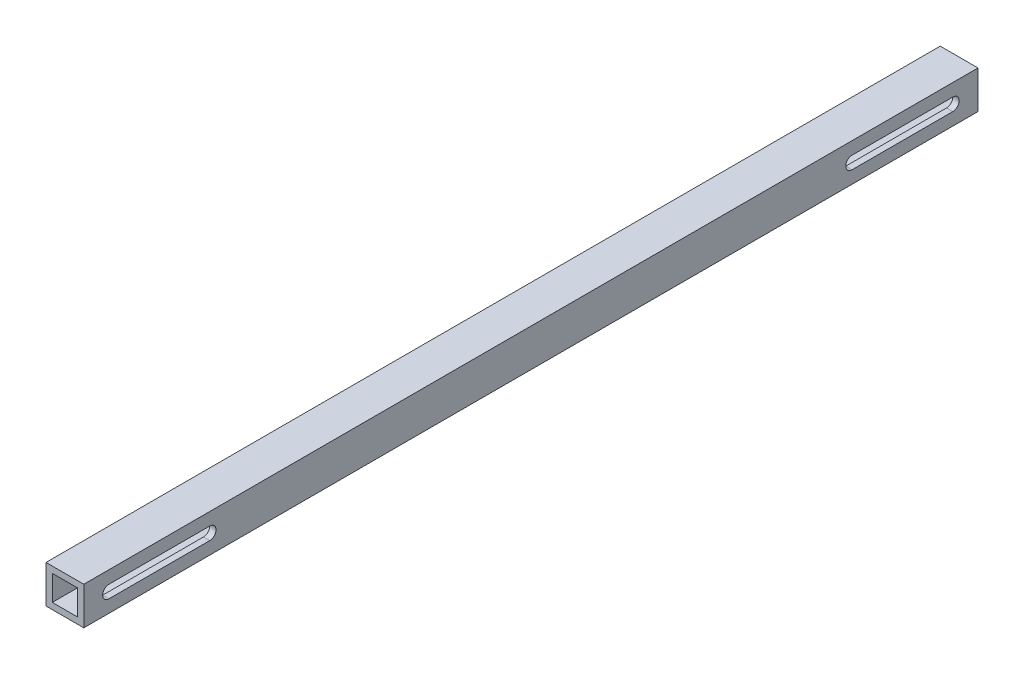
ISO-10303-21;
HEADER;
FILE_DESCRIPTION(('STEP AP214'),'2;1');
FILE_NAME('part.step','',(''),(''),'','','');
FILE_SCHEMA(('AUTOMOTIVE_DESIGN { 1 0 10303 214 1 1 1 1 }'));
ENDSEC;
DATA;
#1=APPLICATION_CONTEXT('core data for automotive mechanical design processes');
#2=APPLICATION_PROTOCOL_DEFINITION('international standard','automotive_design',2000,#1);
#3=PRODUCT_CONTEXT('',#1,'mechanical');
#4=PRODUCT('Part','Part','',(#3));
#5=PRODUCT_RELATED_PRODUCT_CATEGORY('part','',(#4));
#6=PRODUCT_DEFINITION_FORMATION('','',#4);
#7=PRODUCT_DEFINITION_CONTEXT('part definition',#1,'design');
#8=PRODUCT_DEFINITION('design','',#6,#7);
#9=PRODUCT_DEFINITION_SHAPE('','',#8);
#10=(LENGTH_UNIT() NAMED_UNIT(*) SI_UNIT(.MILLI.,.METRE.));
#11=(NAMED_UNIT(*) PLANE_ANGLE_UNIT() SI_UNIT($,.RADIAN.));
#12=(NAMED_UNIT(*) SI_UNIT($,.STERADIAN.) SOLID_ANGLE_UNIT());
#13=UNCERTAINTY_MEASURE_WITH_UNIT(LENGTH_MEASURE(1.E-05),#10,'distance_accuracy_value','');
#14=(GEOMETRIC_REPRESENTATION_CONTEXT(3) GLOBAL_UNCERTAINTY_ASSIGNED_CONTEXT((#13)) GLOBAL_UNIT_ASSIGNED_CONTEXT((#10,
#11,#12)) REPRESENTATION_CONTEXT('',''));
#15=CARTESIAN_POINT('',(0.,0.,0.));
#16=DIRECTION('',(0.,0.,1.));
#17=DIRECTION('',(1.,0.,0.));
#18=AXIS2_PLACEMENT_3D('',#15,#16,#17);
#19=CARTESIAN_POINT('',(0.,0.,450.85));
#20=DIRECTION('',(0.,0.,-1.));
#21=DIRECTION('',(-1.,0.,0.));
#22=AXIS2_PLACEMENT_3D('',#19,#20,#21);
#23=PLANE('',#22);
#24=DIRECTION('',(0.,1.,0.));
#25=VECTOR('',#24,1.);
#26=CARTESIAN_POINT('',(9.525,-9.525,450.85));
#27=LINE('',#26,#25);
#28=CARTESIAN_POINT('',(9.525,-9.525,450.85));
#29=VERTEX_POINT('',#28);
#30=CARTESIAN_POINT('',(9.525,9.525,450.85));
#31=VERTEX_POINT('',#30);
#32=EDGE_CURVE('E327',#29,#31,#27,.T.);
#33=ORIENTED_EDGE('',*,*,#32,.T.);
#34=DIRECTION('',(-1.,0.,0.));
#35=VECTOR('',#34,1.);
#36=CARTESIAN_POINT('',(-9.525,9.525,450.85));
#37=LINE('',#36,#35);
#38=CARTESIAN_POINT('',(-9.525,9.525,450.85));
#39=VERTEX_POINT('',#38);
#40=EDGE_CURVE('E330',#31,#39,#37,.T.);
#41=ORIENTED_EDGE('',*,*,#40,.T.);
#42=DIRECTION('',(0.,-1.,0.));
#43=VECTOR('',#42,1.);
#44=CARTESIAN_POINT('',(-9.525,-9.525,450.85));
#45=LINE('',#44,#43);
#46=CARTESIAN_POINT('',(-9.525,-9.525,450.85));
#47=VERTEX_POINT('',#46);
#48=EDGE_CURVE('E333',#39,#47,#45,.T.);
#49=ORIENTED_EDGE('',*,*,#48,.T.);
#50=DIRECTION('',(1.,0.,0.));
#51=VECTOR('',#50,1.);
#52=CARTESIAN_POINT('',(-9.525,-9.525,450.85));
#53=LINE('',#52,#51);
#54=EDGE_CURVE('E335',#47,#29,#53,.T.);
#55=ORIENTED_EDGE('',*,*,#54,.T.);
#56=EDGE_LOOP('',(#33,#41,#49,#55));
#57=FACE_BOUND('',#56,.T.);
#58=DIRECTION('',(0.,-1.,0.));
#59=VECTOR('',#58,1.);
#60=CARTESIAN_POINT('',(-6.35,-6.35,450.85));
#61=LINE('',#60,#59);
#62=CARTESIAN_POINT('',(-6.35,6.35,450.85));
#63=VERTEX_POINT('',#62);
#64=CARTESIAN_POINT('',(-6.35,-6.35,450.85));
#65=VERTEX_POINT('',#64);
#66=EDGE_CURVE('E296',#63,#65,#61,.T.);
#67=ORIENTED_EDGE('',*,*,#66,.F.);
#68=DIRECTION('',(-1.,0.,0.));
#69=VECTOR('',#68,1.);
#70=CARTESIAN_POINT('',(-6.35,6.35,450.85));
#71=LINE('',#70,#69);
#72=CARTESIAN_POINT('',(6.35,6.35,450.85));
#73=VERTEX_POINT('',#72);
#74=EDGE_CURVE('E304',#73,#63,#71,.T.);
#75=ORIENTED_EDGE('',*,*,#74,.F.);
#76=DIRECTION('',(0.,1.,0.));
#77=VECTOR('',#76,1.);
#78=CARTESIAN_POINT('',(6.35,-6.35,450.85));
#79=LINE('',#78,#77);
#80=CARTESIAN_POINT('',(6.35,-6.35,450.85));
#81=VERTEX_POINT('',#80);
#82=EDGE_CURVE('E301',#81,#73,#79,.T.);
#83=ORIENTED_EDGE('',*,*,#82,.F.);
#84=DIRECTION('',(1.,0.,0.));
#85=VECTOR('',#84,1.);
#86=CARTESIAN_POINT('',(-6.35,-6.35,450.85));
#87=LINE('',#86,#85);
#88=EDGE_CURVE('E298',#65,#81,#87,.T.);
#89=ORIENTED_EDGE('',*,*,#88,.F.);
#90=EDGE_LOOP('',(#67,#75,#83,#89));
#91=FACE_BOUND('',#90,.T.);
#92=ADVANCED_FACE('F33',(#57,#91),#23,.F.);
#93=CARTESIAN_POINT('',(0.,0.,0.));
#94=DIRECTION('',(0.,0.,-1.));
#95=DIRECTION('',(-1.,0.,0.));
#96=AXIS2_PLACEMENT_3D('',#93,#94,#95);
#97=PLANE('',#96);
#98=DIRECTION('',(0.,1.,0.));
#99=VECTOR('',#98,1.);
#100=CARTESIAN_POINT('',(9.525,-9.525,0.));
#101=LINE('',#100,#99);
#102=CARTESIAN_POINT('',(9.525,-9.525,0.));
#103=VERTEX_POINT('',#102);
#104=CARTESIAN_POINT('',(9.525,9.525,0.));
#105=VERTEX_POINT('',#104);
#106=EDGE_CURVE('E326',#103,#105,#101,.T.);
#107=ORIENTED_EDGE('',*,*,#106,.F.);
#108=DIRECTION('',(1.,0.,0.));
#109=VECTOR('',#108,1.);
#110=CARTESIAN_POINT('',(-9.525,-9.525,0.));
#111=LINE('',#110,#109);
#112=CARTESIAN_POINT('',(-9.525,-9.525,0.));
#113=VERTEX_POINT('',#112);
#114=EDGE_CURVE('E331',#113,#103,#111,.T.);
#115=ORIENTED_EDGE('',*,*,#114,.F.);
#116=DIRECTION('',(0.,-1.,0.));
#117=VECTOR('',#116,1.);
#118=CARTESIAN_POINT('',(-9.525,-9.525,0.));
#119=LINE('',#118,#117);
#120=CARTESIAN_POINT('',(-9.525,9.525,0.));
#121=VERTEX_POINT('',#120);
#122=EDGE_CURVE('E342',#121,#113,#119,.T.);
#123=ORIENTED_EDGE('',*,*,#122,.F.);
#124=DIRECTION('',(-1.,0.,0.));
#125=VECTOR('',#124,1.);
#126=CARTESIAN_POINT('',(-9.525,9.525,0.));
#127=LINE('',#126,#125);
#128=EDGE_CURVE('E340',#105,#121,#127,.T.);
#129=ORIENTED_EDGE('',*,*,#128,.F.);
#130=EDGE_LOOP('',(#107,#115,#123,#129));
#131=FACE_BOUND('',#130,.T.);
#132=DIRECTION('',(-1.,0.,0.));
#133=VECTOR('',#132,1.);
#134=CARTESIAN_POINT('',(-6.35,6.35,0.));
#135=LINE('',#134,#133);
#136=CARTESIAN_POINT('',(6.35,6.35,0.));
#137=VERTEX_POINT('',#136);
#138=CARTESIAN_POINT('',(-6.35,6.35,0.));
#139=VERTEX_POINT('',#138);
#140=EDGE_CURVE('E299',#137,#139,#135,.T.);
#141=ORIENTED_EDGE('',*,*,#140,.T.);
#142=DIRECTION('',(0.,-1.,0.));
#143=VECTOR('',#142,1.);
#144=CARTESIAN_POINT('',(-6.35,-6.35,0.));
#145=LINE('',#144,#143);
#146=CARTESIAN_POINT('',(-6.35,-6.35,0.));
#147=VERTEX_POINT('',#146);
#148=EDGE_CURVE('E295',#139,#147,#145,.T.);
#149=ORIENTED_EDGE('',*,*,#148,.T.);
#150=DIRECTION('',(1.,0.,0.));
#151=VECTOR('',#150,1.);
#152=CARTESIAN_POINT('',(-6.35,-6.35,0.));
#153=LINE('',#152,#151);
#154=CARTESIAN_POINT('',(6.35,-6.35,0.));
#155=VERTEX_POINT('',#154);
#156=EDGE_CURVE('E309',#147,#155,#153,.T.);
#157=ORIENTED_EDGE('',*,*,#156,.T.);
#158=DIRECTION('',(0.,1.,0.));
#159=VECTOR('',#158,1.);
#160=CARTESIAN_POINT('',(6.35,-6.35,0.));
#161=LINE('',#160,#159);
#162=EDGE_CURVE('E312',#155,#137,#161,.T.);
#163=ORIENTED_EDGE('',*,*,#162,.T.);
#164=EDGE_LOOP('',(#141,#149,#157,#163));
#165=FACE_BOUND('',#164,.T.);
#166=ADVANCED_FACE('F391',(#131,#165),#97,.T.);
#167=CARTESIAN_POINT('',(9.525,-9.525,450.85));
#168=DIRECTION('',(-1.,0.,0.));
#169=DIRECTION('',(0.,0.,1.));
#170=AXIS2_PLACEMENT_3D('',#167,#168,#169);
#171=PLANE('',#170);
#172=DIRECTION('',(0.,0.,1.));
#173=VECTOR('',#172,1.);
#174=CARTESIAN_POINT('',(9.525,-3.175,438.15));
#175=LINE('',#174,#173);
#176=CARTESIAN_POINT('',(9.525,-3.17500000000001,387.35));
#177=VERTEX_POINT('',#176);
#178=CARTESIAN_POINT('',(9.525,-3.175,438.15));
#179=VERTEX_POINT('',#178);
#180=EDGE_CURVE('E216',#177,#179,#175,.T.);
#181=ORIENTED_EDGE('',*,*,#180,.T.);
#182=CARTESIAN_POINT('',(9.525,0.,438.15));
#183=DIRECTION('',(-1.,0.,0.));
#184=DIRECTION('',(0.,0.,1.));
#185=AXIS2_PLACEMENT_3D('',#182,#183,#184);
#186=CIRCLE('',#185,3.175);
#187=CARTESIAN_POINT('',(9.525,3.175,438.15));
#188=VERTEX_POINT('',#187);
#189=EDGE_CURVE('E200',#179,#188,#186,.T.);
#190=ORIENTED_EDGE('',*,*,#189,.T.);
#191=DIRECTION('',(0.,0.,-1.));
#192=VECTOR('',#191,1.);
#193=CARTESIAN_POINT('',(9.525,3.175,438.15));
#194=LINE('',#193,#192);
#195=CARTESIAN_POINT('',(9.525,3.17499999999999,387.35));
#196=VERTEX_POINT('',#195);
#197=EDGE_CURVE('E209',#188,#196,#194,.T.);
#198=ORIENTED_EDGE('',*,*,#197,.T.);
#199=CARTESIAN_POINT('',(9.525,0.,387.35));
#200=DIRECTION('',(-1.,0.,0.));
#201=DIRECTION('',(0.,0.,1.));
#202=AXIS2_PLACEMENT_3D('',#199,#200,#201);
#203=CIRCLE('',#202,3.175);
#204=EDGE_CURVE('E48',#196,#177,#203,.T.);
#205=ORIENTED_EDGE('',*,*,#204,.T.);
#206=EDGE_LOOP('',(#181,#190,#198,#205));
#207=FACE_BOUND('',#206,.T.);
#208=DIRECTION('',(0.,0.,-1.));
#209=VECTOR('',#208,1.);
#210=CARTESIAN_POINT('',(9.525,3.175,12.7));
#211=LINE('',#210,#209);
#212=CARTESIAN_POINT('',(9.525,3.175,63.5));
#213=VERTEX_POINT('',#212);
#214=CARTESIAN_POINT('',(9.525,3.175,12.7));
#215=VERTEX_POINT('',#214);
#216=EDGE_CURVE('E259',#213,#215,#211,.T.);
#217=ORIENTED_EDGE('',*,*,#216,.T.);
#218=CARTESIAN_POINT('',(9.525,0.,12.7));
#219=DIRECTION('',(-1.,0.,0.));
#220=DIRECTION('',(0.,0.,1.));
#221=AXIS2_PLACEMENT_3D('',#218,#219,#220);
#222=CIRCLE('',#221,3.175);
#223=CARTESIAN_POINT('',(9.525,-3.175,12.7));
#224=VERTEX_POINT('',#223);
#225=EDGE_CURVE('E249',#215,#224,#222,.T.);
#226=ORIENTED_EDGE('',*,*,#225,.T.);
#227=DIRECTION('',(0.,0.,1.));
#228=VECTOR('',#227,1.);
#229=CARTESIAN_POINT('',(9.525,-3.175,12.7));
#230=LINE('',#229,#228);
#231=CARTESIAN_POINT('',(9.525,-3.175,63.5000000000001));
#232=VERTEX_POINT('',#231);
#233=EDGE_CURVE('E252',#224,#232,#230,.T.);
#234=ORIENTED_EDGE('',*,*,#233,.T.);
#235=CARTESIAN_POINT('',(9.525,0.,63.5));
#236=DIRECTION('',(-1.,0.,0.));
#237=DIRECTION('',(0.,0.,1.));
#238=AXIS2_PLACEMENT_3D('',#235,#236,#237);
#239=CIRCLE('',#238,3.175);
#240=EDGE_CURVE('E256',#232,#213,#239,.T.);
#241=ORIENTED_EDGE('',*,*,#240,.T.);
#242=EDGE_LOOP('',(#217,#226,#234,#241));
#243=FACE_BOUND('',#242,.T.);
#244=ORIENTED_EDGE('',*,*,#106,.T.);
#245=DIRECTION('',(0.,0.,-1.));
#246=VECTOR('',#245,1.);
#247=CARTESIAN_POINT('',(9.525,9.525,450.85));
#248=LINE('',#247,#246);
#249=EDGE_CURVE('E353',#31,#105,#248,.T.);
#250=ORIENTED_EDGE('',*,*,#249,.F.);
#251=ORIENTED_EDGE('',*,*,#32,.F.);
#252=DIRECTION('',(0.,0.,-1.));
#253=VECTOR('',#252,1.);
#254=CARTESIAN_POINT('',(9.525,-9.525,450.85));
#255=LINE('',#254,#253);
#256=EDGE_CURVE('E337',#29,#103,#255,.T.);
#257=ORIENTED_EDGE('',*,*,#256,.T.);
#258=EDGE_LOOP('',(#244,#250,#251,#257));
#259=FACE_BOUND('',#258,.T.);
#260=ADVANCED_FACE('F35',(#207,#243,#259),#171,.F.);
#261=CARTESIAN_POINT('',(-9.525,9.525,450.85));
#262=DIRECTION('',(0.,-1.,0.));
#263=DIRECTION('',(0.,0.,-1.));
#264=AXIS2_PLACEMENT_3D('',#261,#262,#263);
#265=PLANE('',#264);
#266=ORIENTED_EDGE('',*,*,#128,.T.);
#267=DIRECTION('',(0.,0.,-1.));
#268=VECTOR('',#267,1.);
#269=CARTESIAN_POINT('',(-9.525,9.525,450.85));
#270=LINE('',#269,#268);
#271=EDGE_CURVE('E350',#39,#121,#270,.T.);
#272=ORIENTED_EDGE('',*,*,#271,.F.);
#273=ORIENTED_EDGE('',*,*,#40,.F.);
#274=ORIENTED_EDGE('',*,*,#249,.T.);
#275=EDGE_LOOP('',(#266,#272,#273,#274));
#276=FACE_BOUND('',#275,.T.);
#277=ADVANCED_FACE('F410',(#276),#265,.F.);
#278=CARTESIAN_POINT('',(-9.525,-9.525,450.85));
#279=DIRECTION('',(1.,0.,0.));
#280=DIRECTION('',(0.,0.,-1.));
#281=AXIS2_PLACEMENT_3D('',#278,#279,#280);
#282=PLANE('',#281);
#283=DIRECTION('',(0.,0.,-1.));
#284=VECTOR('',#283,1.);
#285=CARTESIAN_POINT('',(-9.525,3.175,438.15));
#286=LINE('',#285,#284);
#287=CARTESIAN_POINT('',(-9.525,3.175,438.15));
#288=VERTEX_POINT('',#287);
#289=CARTESIAN_POINT('',(-9.525,3.17499999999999,387.35));
#290=VERTEX_POINT('',#289);
#291=EDGE_CURVE('E226',#288,#290,#286,.T.);
#292=ORIENTED_EDGE('',*,*,#291,.F.);
#293=CARTESIAN_POINT('',(-9.525,0.,438.15));
#294=DIRECTION('',(-1.,0.,0.));
#295=DIRECTION('',(0.,0.,1.));
#296=AXIS2_PLACEMENT_3D('',#293,#294,#295);
#297=CIRCLE('',#296,3.175);
#298=CARTESIAN_POINT('',(-9.525,-3.175,438.15));
#299=VERTEX_POINT('',#298);
#300=EDGE_CURVE('E56',#299,#288,#297,.T.);
#301=ORIENTED_EDGE('',*,*,#300,.F.);
#302=DIRECTION('',(0.,0.,1.));
#303=VECTOR('',#302,1.);
#304=CARTESIAN_POINT('',(-9.525,-3.175,438.15));
#305=LINE('',#304,#303);
#306=CARTESIAN_POINT('',(-9.525,-3.17500000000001,387.35));
#307=VERTEX_POINT('',#306);
#308=EDGE_CURVE('E217',#307,#299,#305,.T.);
#309=ORIENTED_EDGE('',*,*,#308,.F.);
#310=CARTESIAN_POINT('',(-9.525,0.,387.35));
#311=DIRECTION('',(-1.,0.,0.));
#312=DIRECTION('',(0.,0.,1.));
#313=AXIS2_PLACEMENT_3D('',#310,#311,#312);
#314=CIRCLE('',#313,3.175);
#315=EDGE_CURVE('E220',#290,#307,#314,.T.);
#316=ORIENTED_EDGE('',*,*,#315,.F.);
#317=EDGE_LOOP('',(#292,#301,#309,#316));
#318=FACE_BOUND('',#317,.T.);
#319=DIRECTION('',(0.,0.,1.));
#320=VECTOR('',#319,1.);
#321=CARTESIAN_POINT('',(-9.525,-3.175,12.7));
#322=LINE('',#321,#320);
#323=CARTESIAN_POINT('',(-9.525,-3.175,12.7));
#324=VERTEX_POINT('',#323);
#325=CARTESIAN_POINT('',(-9.525,-3.175,63.5));
#326=VERTEX_POINT('',#325);
#327=EDGE_CURVE('E264',#324,#326,#322,.T.);
#328=ORIENTED_EDGE('',*,*,#327,.F.);
#329=CARTESIAN_POINT('',(-9.525,0.,12.7));
#330=DIRECTION('',(-1.,0.,0.));
#331=DIRECTION('',(0.,0.,1.));
#332=AXIS2_PLACEMENT_3D('',#329,#330,#331);
#333=CIRCLE('',#332,3.175);
#334=CARTESIAN_POINT('',(-9.525,3.175,12.7));
#335=VERTEX_POINT('',#334);
#336=EDGE_CURVE('E248',#335,#324,#333,.T.);
#337=ORIENTED_EDGE('',*,*,#336,.F.);
#338=DIRECTION('',(0.,0.,-1.));
#339=VECTOR('',#338,1.);
#340=CARTESIAN_POINT('',(-9.525,3.175,12.7));
#341=LINE('',#340,#339);
#342=CARTESIAN_POINT('',(-9.525,3.175,63.5));
#343=VERTEX_POINT('',#342);
#344=EDGE_CURVE('E253',#343,#335,#341,.T.);
#345=ORIENTED_EDGE('',*,*,#344,.F.);
#346=CARTESIAN_POINT('',(-9.525,0.,63.5));
#347=DIRECTION('',(-1.,0.,0.));
#348=DIRECTION('',(0.,0.,1.));
#349=AXIS2_PLACEMENT_3D('',#346,#347,#348);
#350=CIRCLE('',#349,3.175);
#351=EDGE_CURVE('E267',#326,#343,#350,.T.);
#352=ORIENTED_EDGE('',*,*,#351,.F.);
#353=EDGE_LOOP('',(#328,#337,#345,#352));
#354=FACE_BOUND('',#353,.T.);
#355=ORIENTED_EDGE('',*,*,#122,.T.);
#356=DIRECTION('',(0.,0.,-1.));
#357=VECTOR('',#356,1.);
#358=CARTESIAN_POINT('',(-9.525,-9.525,450.85));
#359=LINE('',#358,#357);
#360=EDGE_CURVE('E347',#47,#113,#359,.T.);
#361=ORIENTED_EDGE('',*,*,#360,.F.);
#362=ORIENTED_EDGE('',*,*,#48,.F.);
#363=ORIENTED_EDGE('',*,*,#271,.T.);
#364=EDGE_LOOP('',(#355,#361,#362,#363));
#365=FACE_BOUND('',#364,.T.);
#366=ADVANCED_FACE('F407',(#318,#354,#365),#282,.F.);
#367=CARTESIAN_POINT('',(-9.525,-9.525,450.85));
#368=DIRECTION('',(0.,1.,0.));
#369=DIRECTION('',(0.,0.,1.));
#370=AXIS2_PLACEMENT_3D('',#367,#368,#369);
#371=PLANE('',#370);
#372=ORIENTED_EDGE('',*,*,#114,.T.);
#373=ORIENTED_EDGE('',*,*,#256,.F.);
#374=ORIENTED_EDGE('',*,*,#54,.F.);
#375=ORIENTED_EDGE('',*,*,#360,.T.);
#376=EDGE_LOOP('',(#372,#373,#374,#375));
#377=FACE_BOUND('',#376,.T.);
#378=ADVANCED_FACE('F404',(#377),#371,.F.);
#379=CARTESIAN_POINT('',(-6.35,-6.35,450.85));
#380=DIRECTION('',(1.,0.,0.));
#381=DIRECTION('',(0.,0.,-1.));
#382=AXIS2_PLACEMENT_3D('',#379,#380,#381);
#383=PLANE('',#382);
#384=CARTESIAN_POINT('',(-6.35,0.,438.15));
#385=DIRECTION('',(1.,0.,0.));
#386=DIRECTION('',(0.,0.,-1.));
#387=AXIS2_PLACEMENT_3D('',#384,#385,#386);
#388=CIRCLE('',#387,3.175);
#389=CARTESIAN_POINT('',(-6.34999999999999,3.175,438.15));
#390=VERTEX_POINT('',#389);
#391=CARTESIAN_POINT('',(-6.34999999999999,-3.175,438.15));
#392=VERTEX_POINT('',#391);
#393=EDGE_CURVE('E246',#390,#392,#388,.T.);
#394=ORIENTED_EDGE('',*,*,#393,.F.);
#395=DIRECTION('',(0.,0.,1.));
#396=VECTOR('',#395,1.);
#397=CARTESIAN_POINT('',(-6.35,3.175,450.85));
#398=LINE('',#397,#396);
#399=CARTESIAN_POINT('',(-6.35,3.17499999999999,387.35));
#400=VERTEX_POINT('',#399);
#401=EDGE_CURVE('E233',#400,#390,#398,.T.);
#402=ORIENTED_EDGE('',*,*,#401,.F.);
#403=CARTESIAN_POINT('',(-6.35,0.,387.35));
#404=DIRECTION('',(1.,0.,0.));
#405=DIRECTION('',(0.,0.,-1.));
#406=AXIS2_PLACEMENT_3D('',#403,#404,#405);
#407=CIRCLE('',#406,3.175);
#408=CARTESIAN_POINT('',(-6.34999999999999,-3.17500000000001,387.35));
#409=VERTEX_POINT('',#408);
#410=EDGE_CURVE('E241',#409,#400,#407,.T.);
#411=ORIENTED_EDGE('',*,*,#410,.F.);
#412=DIRECTION('',(0.,0.,-1.));
#413=VECTOR('',#412,1.);
#414=CARTESIAN_POINT('',(-6.35,-3.175,450.85));
#415=LINE('',#414,#413);
#416=EDGE_CURVE('E244',#392,#409,#415,.T.);
#417=ORIENTED_EDGE('',*,*,#416,.F.);
#418=EDGE_LOOP('',(#394,#402,#411,#417));
#419=FACE_BOUND('',#418,.T.);
#420=CARTESIAN_POINT('',(-6.35,0.,12.7));
#421=DIRECTION('',(1.,0.,0.));
#422=DIRECTION('',(0.,0.,-1.));
#423=AXIS2_PLACEMENT_3D('',#420,#421,#422);
#424=CIRCLE('',#423,3.175);
#425=CARTESIAN_POINT('',(-6.34999999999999,-3.175,12.7));
#426=VERTEX_POINT('',#425);
#427=CARTESIAN_POINT('',(-6.34999999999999,3.175,12.7));
#428=VERTEX_POINT('',#427);
#429=EDGE_CURVE('E293',#426,#428,#424,.T.);
#430=ORIENTED_EDGE('',*,*,#429,.F.);
#431=DIRECTION('',(0.,0.,-1.));
#432=VECTOR('',#431,1.);
#433=CARTESIAN_POINT('',(-6.35,-3.175,450.85));
#434=LINE('',#433,#432);
#435=CARTESIAN_POINT('',(-6.35,-3.175,63.5000000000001));
#436=VERTEX_POINT('',#435);
#437=EDGE_CURVE('E275',#436,#426,#434,.T.);
#438=ORIENTED_EDGE('',*,*,#437,.F.);
#439=CARTESIAN_POINT('',(-6.35,0.,63.5));
#440=DIRECTION('',(1.,0.,0.));
#441=DIRECTION('',(0.,0.,-1.));
#442=AXIS2_PLACEMENT_3D('',#439,#440,#441);
#443=CIRCLE('',#442,3.175);
#444=CARTESIAN_POINT('',(-6.34999999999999,3.175,63.5));
#445=VERTEX_POINT('',#444);
#446=EDGE_CURVE('E288',#445,#436,#443,.T.);
#447=ORIENTED_EDGE('',*,*,#446,.F.);
#448=DIRECTION('',(0.,0.,1.));
#449=VECTOR('',#448,1.);
#450=CARTESIAN_POINT('',(-6.35,3.175,450.85));
#451=LINE('',#450,#449);
#452=EDGE_CURVE('E291',#428,#445,#451,.T.);
#453=ORIENTED_EDGE('',*,*,#452,.F.);
#454=EDGE_LOOP('',(#430,#438,#447,#453));
#455=FACE_BOUND('',#454,.T.);
#456=ORIENTED_EDGE('',*,*,#148,.F.);
#457=DIRECTION('',(0.,0.,-1.));
#458=VECTOR('',#457,1.);
#459=CARTESIAN_POINT('',(-6.35,6.35,450.85));
#460=LINE('',#459,#458);
#461=EDGE_CURVE('E306',#63,#139,#460,.T.);
#462=ORIENTED_EDGE('',*,*,#461,.F.);
#463=ORIENTED_EDGE('',*,*,#66,.T.);
#464=DIRECTION('',(0.,0.,-1.));
#465=VECTOR('',#464,1.);
#466=CARTESIAN_POINT('',(-6.35,-6.35,450.85));
#467=LINE('',#466,#465);
#468=EDGE_CURVE('E323',#65,#147,#467,.T.);
#469=ORIENTED_EDGE('',*,*,#468,.T.);
#470=EDGE_LOOP('',(#456,#462,#463,#469));
#471=FACE_BOUND('',#470,.T.);
#472=ADVANCED_FACE('F401',(#419,#455,#471),#383,.T.);
#473=CARTESIAN_POINT('',(-6.35,-6.35,450.85));
#474=DIRECTION('',(0.,1.,0.));
#475=DIRECTION('',(0.,0.,1.));
#476=AXIS2_PLACEMENT_3D('',#473,#474,#475);
#477=PLANE('',#476);
#478=ORIENTED_EDGE('',*,*,#156,.F.);
#479=ORIENTED_EDGE('',*,*,#468,.F.);
#480=ORIENTED_EDGE('',*,*,#88,.T.);
#481=DIRECTION('',(0.,0.,-1.));
#482=VECTOR('',#481,1.);
#483=CARTESIAN_POINT('',(6.35,-6.35,450.85));
#484=LINE('',#483,#482);
#485=EDGE_CURVE('E321',#81,#155,#484,.T.);
#486=ORIENTED_EDGE('',*,*,#485,.T.);
#487=EDGE_LOOP('',(#478,#479,#480,#486));
#488=FACE_BOUND('',#487,.T.);
#489=ADVANCED_FACE('F445',(#488),#477,.T.);
#490=CARTESIAN_POINT('',(6.35,-6.35,450.85));
#491=DIRECTION('',(-1.,0.,0.));
#492=DIRECTION('',(0.,-1.,0.));
#493=AXIS2_PLACEMENT_3D('',#490,#491,#492);
#494=PLANE('',#493);
#495=CARTESIAN_POINT('',(6.35,0.,438.15));
#496=DIRECTION('',(-1.,0.,0.));
#497=DIRECTION('',(0.,-1.,0.));
#498=AXIS2_PLACEMENT_3D('',#495,#496,#497);
#499=CIRCLE('',#498,3.175);
#500=CARTESIAN_POINT('',(6.35,-3.175,438.15));
#501=VERTEX_POINT('',#500);
#502=CARTESIAN_POINT('',(6.35,3.175,438.15));
#503=VERTEX_POINT('',#502);
#504=EDGE_CURVE('E11',#501,#503,#499,.T.);
#505=ORIENTED_EDGE('',*,*,#504,.F.);
#506=DIRECTION('',(0.,0.,1.));
#507=VECTOR('',#506,1.);
#508=CARTESIAN_POINT('',(6.35,-3.175,450.85));
#509=LINE('',#508,#507);
#510=CARTESIAN_POINT('',(6.35,-3.17500000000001,387.35));
#511=VERTEX_POINT('',#510);
#512=EDGE_CURVE('E41',#511,#501,#509,.T.);
#513=ORIENTED_EDGE('',*,*,#512,.F.);
#514=CARTESIAN_POINT('',(6.35,0.,387.35));
#515=DIRECTION('',(-1.,0.,0.));
#516=DIRECTION('',(0.,-1.,0.));
#517=AXIS2_PLACEMENT_3D('',#514,#515,#516);
#518=CIRCLE('',#517,3.175);
#519=CARTESIAN_POINT('',(6.35,3.17499999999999,387.35));
#520=VERTEX_POINT('',#519);
#521=EDGE_CURVE('E367',#520,#511,#518,.T.);
#522=ORIENTED_EDGE('',*,*,#521,.F.);
#523=DIRECTION('',(0.,0.,-1.));
#524=VECTOR('',#523,1.);
#525=CARTESIAN_POINT('',(6.35,3.175,450.85));
#526=LINE('',#525,#524);
#527=EDGE_CURVE('E365',#503,#520,#526,.T.);
#528=ORIENTED_EDGE('',*,*,#527,.F.);
#529=EDGE_LOOP('',(#505,#513,#522,#528));
#530=FACE_BOUND('',#529,.T.);
#531=CARTESIAN_POINT('',(6.35,0.,12.7));
#532=DIRECTION('',(-1.,0.,0.));
#533=DIRECTION('',(0.,-1.,0.));
#534=AXIS2_PLACEMENT_3D('',#531,#532,#533);
#535=CIRCLE('',#534,3.175);
#536=CARTESIAN_POINT('',(6.35,3.175,12.7));
#537=VERTEX_POINT('',#536);
#538=CARTESIAN_POINT('',(6.35,-3.175,12.7));
#539=VERTEX_POINT('',#538);
#540=EDGE_CURVE('E362',#537,#539,#535,.T.);
#541=ORIENTED_EDGE('',*,*,#540,.F.);
#542=DIRECTION('',(0.,0.,-1.));
#543=VECTOR('',#542,1.);
#544=CARTESIAN_POINT('',(6.35,3.175,450.85));
#545=LINE('',#544,#543);
#546=CARTESIAN_POINT('',(6.35,3.175,63.5));
#547=VERTEX_POINT('',#546);
#548=EDGE_CURVE('E360',#547,#537,#545,.T.);
#549=ORIENTED_EDGE('',*,*,#548,.F.);
#550=CARTESIAN_POINT('',(6.35,0.,63.5));
#551=DIRECTION('',(-1.,0.,0.));
#552=DIRECTION('',(0.,-1.,0.));
#553=AXIS2_PLACEMENT_3D('',#550,#551,#552);
#554=CIRCLE('',#553,3.175);
#555=CARTESIAN_POINT('',(6.35,-3.175,63.5));
#556=VERTEX_POINT('',#555);
#557=EDGE_CURVE('E358',#556,#547,#554,.T.);
#558=ORIENTED_EDGE('',*,*,#557,.F.);
#559=DIRECTION('',(0.,0.,1.));
#560=VECTOR('',#559,1.);
#561=CARTESIAN_POINT('',(6.35,-3.175,450.85));
#562=LINE('',#561,#560);
#563=EDGE_CURVE('E356',#539,#556,#562,.T.);
#564=ORIENTED_EDGE('',*,*,#563,.F.);
#565=EDGE_LOOP('',(#541,#549,#558,#564));
#566=FACE_BOUND('',#565,.T.);
#567=ORIENTED_EDGE('',*,*,#162,.F.);
#568=ORIENTED_EDGE('',*,*,#485,.F.);
#569=ORIENTED_EDGE('',*,*,#82,.T.);
#570=DIRECTION('',(0.,0.,-1.));
#571=VECTOR('',#570,1.);
#572=CARTESIAN_POINT('',(6.35,6.35,450.85));
#573=LINE('',#572,#571);
#574=EDGE_CURVE('E319',#73,#137,#573,.T.);
#575=ORIENTED_EDGE('',*,*,#574,.T.);
#576=EDGE_LOOP('',(#567,#568,#569,#575));
#577=FACE_BOUND('',#576,.T.);
#578=ADVANCED_FACE('F373',(#530,#566,#577),#494,.T.);
#579=CARTESIAN_POINT('',(-6.35,6.35,450.85));
#580=DIRECTION('',(0.,-1.,0.));
#581=DIRECTION('',(1.,0.,0.));
#582=AXIS2_PLACEMENT_3D('',#579,#580,#581);
#583=PLANE('',#582);
#584=ORIENTED_EDGE('',*,*,#140,.F.);
#585=ORIENTED_EDGE('',*,*,#574,.F.);
#586=ORIENTED_EDGE('',*,*,#74,.T.);
#587=ORIENTED_EDGE('',*,*,#461,.T.);
#588=EDGE_LOOP('',(#584,#585,#586,#587));
#589=FACE_BOUND('',#588,.T.);
#590=ADVANCED_FACE('F435',(#589),#583,.T.);
#591=CARTESIAN_POINT('',(9.525,-3.175,12.7));
#592=DIRECTION('',(0.,-1.,0.));
#593=DIRECTION('',(0.,0.,-1.));
#594=AXIS2_PLACEMENT_3D('',#591,#592,#593);
#595=PLANE('',#594);
#596=ORIENTED_EDGE('',*,*,#563,.T.);
#597=DIRECTION('',(-1.,0.,0.));
#598=VECTOR('',#597,1.);
#599=CARTESIAN_POINT('',(9.525,-3.175,63.5));
#600=LINE('',#599,#598);
#601=EDGE_CURVE('E281',#232,#556,#600,.T.);
#602=ORIENTED_EDGE('',*,*,#601,.F.);
#603=ORIENTED_EDGE('',*,*,#233,.F.);
#604=DIRECTION('',(-1.,0.,0.));
#605=VECTOR('',#604,1.);
#606=CARTESIAN_POINT('',(9.525,-3.175,12.7));
#607=LINE('',#606,#605);
#608=EDGE_CURVE('E285',#224,#539,#607,.T.);
#609=ORIENTED_EDGE('',*,*,#608,.T.);
#610=EDGE_LOOP('',(#596,#602,#603,#609));
#611=FACE_BOUND('',#610,.T.);
#612=ADVANCED_FACE('F454',(#611),#595,.F.);
#613=CARTESIAN_POINT('',(9.525,0.,63.5));
#614=DIRECTION('',(-1.,0.,0.));
#615=DIRECTION('',(0.,0.,1.));
#616=AXIS2_PLACEMENT_3D('',#613,#614,#615);
#617=CYLINDRICAL_SURFACE('',#616,3.175);
#618=ORIENTED_EDGE('',*,*,#557,.T.);
#619=DIRECTION('',(-1.,0.,0.));
#620=VECTOR('',#619,1.);
#621=CARTESIAN_POINT('',(9.525,3.175,63.5));
#622=LINE('',#621,#620);
#623=EDGE_CURVE('E277',#213,#547,#622,.T.);
#624=ORIENTED_EDGE('',*,*,#623,.F.);
#625=ORIENTED_EDGE('',*,*,#240,.F.);
#626=ORIENTED_EDGE('',*,*,#601,.T.);
#627=EDGE_LOOP('',(#618,#624,#625,#626));
#628=FACE_BOUND('',#627,.T.);
#629=ADVANCED_FACE('F466',(#628),#617,.F.);
#630=CARTESIAN_POINT('',(9.525,3.175,12.7));
#631=DIRECTION('',(0.,1.,0.));
#632=DIRECTION('',(0.,0.,1.));
#633=AXIS2_PLACEMENT_3D('',#630,#631,#632);
#634=PLANE('',#633);
#635=ORIENTED_EDGE('',*,*,#548,.T.);
#636=DIRECTION('',(-1.,0.,0.));
#637=VECTOR('',#636,1.);
#638=CARTESIAN_POINT('',(9.525,3.175,12.7));
#639=LINE('',#638,#637);
#640=EDGE_CURVE('E272',#215,#537,#639,.T.);
#641=ORIENTED_EDGE('',*,*,#640,.F.);
#642=ORIENTED_EDGE('',*,*,#216,.F.);
#643=ORIENTED_EDGE('',*,*,#623,.T.);
#644=EDGE_LOOP('',(#635,#641,#642,#643));
#645=FACE_BOUND('',#644,.T.);
#646=ADVANCED_FACE('F462',(#645),#634,.F.);
#647=CARTESIAN_POINT('',(9.525,0.,12.7));
#648=DIRECTION('',(-1.,0.,0.));
#649=DIRECTION('',(0.,0.,1.));
#650=AXIS2_PLACEMENT_3D('',#647,#648,#649);
#651=CYLINDRICAL_SURFACE('',#650,3.175);
#652=ORIENTED_EDGE('',*,*,#540,.T.);
#653=ORIENTED_EDGE('',*,*,#608,.F.);
#654=ORIENTED_EDGE('',*,*,#225,.F.);
#655=ORIENTED_EDGE('',*,*,#640,.T.);
#656=EDGE_LOOP('',(#652,#653,#654,#655));
#657=FACE_BOUND('',#656,.T.);
#658=ADVANCED_FACE('F458',(#657),#651,.F.);
#659=ORIENTED_EDGE('',*,*,#429,.T.);
#660=EDGE_CURVE('E276',#428,#335,#639,.T.);
#661=ORIENTED_EDGE('',*,*,#660,.T.);
#662=ORIENTED_EDGE('',*,*,#336,.T.);
#663=EDGE_CURVE('E262',#426,#324,#607,.T.);
#664=ORIENTED_EDGE('',*,*,#663,.F.);
#665=EDGE_LOOP('',(#659,#661,#662,#664));
#666=FACE_BOUND('',#665,.T.);
#667=ADVANCED_FACE('F461',(#666),#651,.F.);
#668=ORIENTED_EDGE('',*,*,#452,.T.);
#669=EDGE_CURVE('E280',#445,#343,#622,.T.);
#670=ORIENTED_EDGE('',*,*,#669,.T.);
#671=ORIENTED_EDGE('',*,*,#344,.T.);
#672=ORIENTED_EDGE('',*,*,#660,.F.);
#673=EDGE_LOOP('',(#668,#670,#671,#672));
#674=FACE_BOUND('',#673,.T.);
#675=ADVANCED_FACE('F475',(#674),#634,.F.);
#676=ORIENTED_EDGE('',*,*,#446,.T.);
#677=EDGE_CURVE('E284',#436,#326,#600,.T.);
#678=ORIENTED_EDGE('',*,*,#677,.T.);
#679=ORIENTED_EDGE('',*,*,#351,.T.);
#680=ORIENTED_EDGE('',*,*,#669,.F.);
#681=EDGE_LOOP('',(#676,#678,#679,#680));
#682=FACE_BOUND('',#681,.T.);
#683=ADVANCED_FACE('F471',(#682),#617,.F.);
#684=ORIENTED_EDGE('',*,*,#437,.T.);
#685=ORIENTED_EDGE('',*,*,#663,.T.);
#686=ORIENTED_EDGE('',*,*,#327,.T.);
#687=ORIENTED_EDGE('',*,*,#677,.F.);
#688=EDGE_LOOP('',(#684,#685,#686,#687));
#689=FACE_BOUND('',#688,.T.);
#690=ADVANCED_FACE('F385',(#689),#595,.F.);
#691=CARTESIAN_POINT('',(9.525,3.175,438.15));
#692=DIRECTION('',(0.,1.,0.));
#693=DIRECTION('',(0.,0.,1.));
#694=AXIS2_PLACEMENT_3D('',#691,#692,#693);
#695=PLANE('',#694);
#696=ORIENTED_EDGE('',*,*,#527,.T.);
#697=DIRECTION('',(-1.,0.,0.));
#698=VECTOR('',#697,1.);
#699=CARTESIAN_POINT('',(9.525,3.17499999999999,387.35));
#700=LINE('',#699,#698);
#701=EDGE_CURVE('E211',#196,#520,#700,.T.);
#702=ORIENTED_EDGE('',*,*,#701,.F.);
#703=ORIENTED_EDGE('',*,*,#197,.F.);
#704=DIRECTION('',(-1.,0.,0.));
#705=VECTOR('',#704,1.);
#706=CARTESIAN_POINT('',(9.525,3.175,438.15));
#707=LINE('',#706,#705);
#708=EDGE_CURVE('E195',#188,#503,#707,.T.);
#709=ORIENTED_EDGE('',*,*,#708,.T.);
#710=EDGE_LOOP('',(#696,#702,#703,#709));
#711=FACE_BOUND('',#710,.T.);
#712=ADVANCED_FACE('F210',(#711),#695,.F.);
#713=CARTESIAN_POINT('',(9.525,0.,387.35));
#714=DIRECTION('',(-1.,0.,0.));
#715=DIRECTION('',(0.,0.,1.));
#716=AXIS2_PLACEMENT_3D('',#713,#714,#715);
#717=CYLINDRICAL_SURFACE('',#716,3.175);
#718=ORIENTED_EDGE('',*,*,#521,.T.);
#719=DIRECTION('',(-1.,0.,0.));
#720=VECTOR('',#719,1.);
#721=CARTESIAN_POINT('',(9.525,-3.17500000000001,387.35));
#722=LINE('',#721,#720);
#723=EDGE_CURVE('E235',#177,#511,#722,.T.);
#724=ORIENTED_EDGE('',*,*,#723,.F.);
#725=ORIENTED_EDGE('',*,*,#204,.F.);
#726=ORIENTED_EDGE('',*,*,#701,.T.);
#727=EDGE_LOOP('',(#718,#724,#725,#726));
#728=FACE_BOUND('',#727,.T.);
#729=ADVANCED_FACE('F375',(#728),#717,.F.);
#730=CARTESIAN_POINT('',(9.525,-3.175,438.15));
#731=DIRECTION('',(0.,-1.,0.));
#732=DIRECTION('',(0.,0.,-1.));
#733=AXIS2_PLACEMENT_3D('',#730,#731,#732);
#734=PLANE('',#733);
#735=ORIENTED_EDGE('',*,*,#512,.T.);
#736=DIRECTION('',(-1.,0.,0.));
#737=VECTOR('',#736,1.);
#738=CARTESIAN_POINT('',(9.525,-3.175,438.15));
#739=LINE('',#738,#737);
#740=EDGE_CURVE('E231',#179,#501,#739,.T.);
#741=ORIENTED_EDGE('',*,*,#740,.F.);
#742=ORIENTED_EDGE('',*,*,#180,.F.);
#743=ORIENTED_EDGE('',*,*,#723,.T.);
#744=EDGE_LOOP('',(#735,#741,#742,#743));
#745=FACE_BOUND('',#744,.T.);
#746=ADVANCED_FACE('F370',(#745),#734,.F.);
#747=CARTESIAN_POINT('',(9.525,0.,438.15));
#748=DIRECTION('',(-1.,0.,0.));
#749=DIRECTION('',(0.,0.,1.));
#750=AXIS2_PLACEMENT_3D('',#747,#748,#749);
#751=CYLINDRICAL_SURFACE('',#750,3.175);
#752=ORIENTED_EDGE('',*,*,#504,.T.);
#753=ORIENTED_EDGE('',*,*,#708,.F.);
#754=ORIENTED_EDGE('',*,*,#189,.F.);
#755=ORIENTED_EDGE('',*,*,#740,.T.);
#756=EDGE_LOOP('',(#752,#753,#754,#755));
#757=FACE_BOUND('',#756,.T.);
#758=ADVANCED_FACE('F197',(#757),#751,.F.);
#759=ORIENTED_EDGE('',*,*,#393,.T.);
#760=EDGE_CURVE('E234',#392,#299,#739,.T.);
#761=ORIENTED_EDGE('',*,*,#760,.T.);
#762=ORIENTED_EDGE('',*,*,#300,.T.);
#763=EDGE_CURVE('E206',#390,#288,#707,.T.);
#764=ORIENTED_EDGE('',*,*,#763,.F.);
#765=EDGE_LOOP('',(#759,#761,#762,#764));
#766=FACE_BOUND('',#765,.T.);
#767=ADVANCED_FACE('F477',(#766),#751,.F.);
#768=ORIENTED_EDGE('',*,*,#416,.T.);
#769=EDGE_CURVE('E238',#409,#307,#722,.T.);
#770=ORIENTED_EDGE('',*,*,#769,.T.);
#771=ORIENTED_EDGE('',*,*,#308,.T.);
#772=ORIENTED_EDGE('',*,*,#760,.F.);
#773=EDGE_LOOP('',(#768,#770,#771,#772));
#774=FACE_BOUND('',#773,.T.);
#775=ADVANCED_FACE('F384',(#774),#734,.F.);
#776=ORIENTED_EDGE('',*,*,#410,.T.);
#777=EDGE_CURVE('E205',#400,#290,#700,.T.);
#778=ORIENTED_EDGE('',*,*,#777,.T.);
#779=ORIENTED_EDGE('',*,*,#315,.T.);
#780=ORIENTED_EDGE('',*,*,#769,.F.);
#781=EDGE_LOOP('',(#776,#778,#779,#780));
#782=FACE_BOUND('',#781,.T.);
#783=ADVANCED_FACE('F378',(#782),#717,.F.);
#784=ORIENTED_EDGE('',*,*,#401,.T.);
#785=ORIENTED_EDGE('',*,*,#763,.T.);
#786=ORIENTED_EDGE('',*,*,#291,.T.);
#787=ORIENTED_EDGE('',*,*,#777,.F.);
#788=EDGE_LOOP('',(#784,#785,#786,#787));
#789=FACE_BOUND('',#788,.T.);
#790=ADVANCED_FACE('F387',(#789),#695,.F.);
#791=CLOSED_SHELL('',(#92,#166,#260,#277,#366,#378,#472,#489,#578,#590,#612,#629,#646,#658,#667,
#675,#683,#690,#712,#729,#746,#758,#767,#775,#783,#790));
#792=MANIFOLD_SOLID_BREP('B2',#791);
#793=ADVANCED_BREP_SHAPE_REPRESENTATION('',(#18,#792),#14);
#794=SHAPE_DEFINITION_REPRESENTATION(#9,#793);
ENDSEC;
END-ISO-10303-21;
